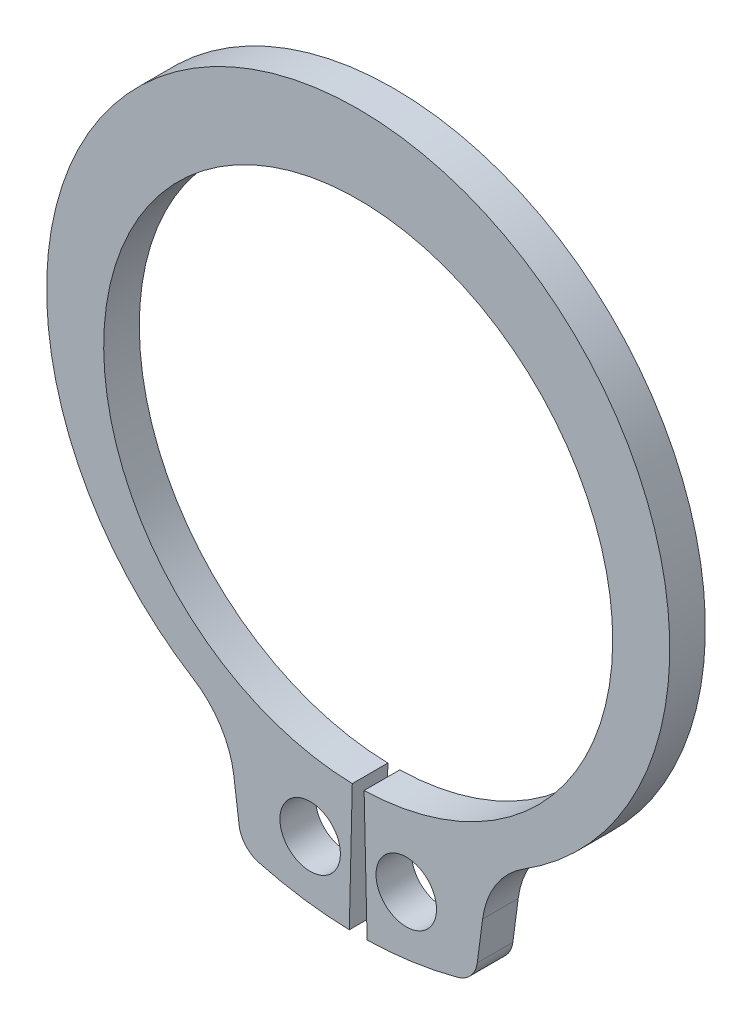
ISO-10303-21;
HEADER;
FILE_DESCRIPTION(('STEP AP214'),'2;1');
FILE_NAME('part.step','',(''),(''),'','','');
FILE_SCHEMA(('AUTOMOTIVE_DESIGN { 1 0 10303 214 1 1 1 1 }'));
ENDSEC;
DATA;
#1=APPLICATION_CONTEXT('core data for automotive mechanical design processes');
#2=APPLICATION_PROTOCOL_DEFINITION('international standard','automotive_design',2000,#1);
#3=PRODUCT_CONTEXT('',#1,'mechanical');
#4=PRODUCT('Part','Part','',(#3));
#5=PRODUCT_RELATED_PRODUCT_CATEGORY('part','',(#4));
#6=PRODUCT_DEFINITION_FORMATION('','',#4);
#7=PRODUCT_DEFINITION_CONTEXT('part definition',#1,'design');
#8=PRODUCT_DEFINITION('design','',#6,#7);
#9=PRODUCT_DEFINITION_SHAPE('','',#8);
#10=(LENGTH_UNIT() NAMED_UNIT(*) SI_UNIT(.MILLI.,.METRE.));
#11=(NAMED_UNIT(*) PLANE_ANGLE_UNIT() SI_UNIT($,.RADIAN.));
#12=(NAMED_UNIT(*) SI_UNIT($,.STERADIAN.) SOLID_ANGLE_UNIT());
#13=UNCERTAINTY_MEASURE_WITH_UNIT(LENGTH_MEASURE(1.E-05),#10,'distance_accuracy_value','');
#14=(GEOMETRIC_REPRESENTATION_CONTEXT(3) GLOBAL_UNCERTAINTY_ASSIGNED_CONTEXT((#13)) GLOBAL_UNIT_ASSIGNED_CONTEXT((#10,
#11,#12)) REPRESENTATION_CONTEXT('',''));
#15=CARTESIAN_POINT('',(0.,0.,0.));
#16=DIRECTION('',(0.,0.,1.));
#17=DIRECTION('',(1.,0.,0.));
#18=AXIS2_PLACEMENT_3D('',#15,#16,#17);
#19=CARTESIAN_POINT('',(0.,0.,-1.));
#20=DIRECTION('',(0.,0.,1.));
#21=DIRECTION('',(1.,0.,0.));
#22=AXIS2_PLACEMENT_3D('',#19,#20,#21);
#23=CYLINDRICAL_SURFACE('',#22,7.15);
#24=CARTESIAN_POINT('',(0.,0.,0.));
#25=DIRECTION('',(0.,0.,-1.));
#26=DIRECTION('',(1.,0.,0.));
#27=AXIS2_PLACEMENT_3D('',#24,#25,#26);
#28=CIRCLE('',#27,7.15);
#29=CARTESIAN_POINT('',(-0.166279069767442,-7.14806626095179,0.));
#30=VERTEX_POINT('',#29);
#31=CARTESIAN_POINT('',(0.166279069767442,-7.14806626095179,0.));
#32=VERTEX_POINT('',#31);
#33=EDGE_CURVE('E153',#30,#32,#28,.T.);
#34=ORIENTED_EDGE('',*,*,#33,.F.);
#35=DIRECTION('',(0.,0.,1.));
#36=VECTOR('',#35,1.);
#37=CARTESIAN_POINT('',(-0.166279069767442,-7.14806626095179,-1.));
#38=LINE('',#37,#36);
#39=CARTESIAN_POINT('',(-0.166279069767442,-7.14806626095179,-1.));
#40=VERTEX_POINT('',#39);
#41=EDGE_CURVE('E11',#40,#30,#38,.T.);
#42=ORIENTED_EDGE('',*,*,#41,.F.);
#43=CARTESIAN_POINT('',(0.,0.,-1.));
#44=DIRECTION('',(0.,0.,-1.));
#45=DIRECTION('',(1.,0.,0.));
#46=AXIS2_PLACEMENT_3D('',#43,#44,#45);
#47=CIRCLE('',#46,7.15);
#48=CARTESIAN_POINT('',(0.166279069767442,-7.14806626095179,-1.));
#49=VERTEX_POINT('',#48);
#50=EDGE_CURVE('E186',#40,#49,#47,.T.);
#51=ORIENTED_EDGE('',*,*,#50,.T.);
#52=DIRECTION('',(0.,0.,1.));
#53=VECTOR('',#52,1.);
#54=CARTESIAN_POINT('',(0.166279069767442,-7.14806626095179,-1.));
#55=LINE('',#54,#53);
#56=EDGE_CURVE('E35',#49,#32,#55,.T.);
#57=ORIENTED_EDGE('',*,*,#56,.T.);
#58=EDGE_LOOP('',(#34,#42,#51,#57));
#59=FACE_BOUND('',#58,.T.);
#60=ADVANCED_FACE('F32',(#59),#23,.F.);
#61=CARTESIAN_POINT('',(-0.166279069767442,-7.14806626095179,-1.));
#62=DIRECTION('',(0.999729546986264,-0.0232558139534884,0.));
#63=DIRECTION('',(0.0232558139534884,0.999729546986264,0.));
#64=AXIS2_PLACEMENT_3D('',#61,#62,#63);
#65=PLANE('',#64);
#66=DIRECTION('',(0.0232558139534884,0.999729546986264,0.));
#67=VECTOR('',#66,1.);
#68=CARTESIAN_POINT('',(-0.166279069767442,-7.14806626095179,0.));
#69=LINE('',#68,#67);
#70=CARTESIAN_POINT('',(-0.25,-10.7470926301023,0.));
#71=VERTEX_POINT('',#70);
#72=EDGE_CURVE('E184',#71,#30,#69,.T.);
#73=ORIENTED_EDGE('',*,*,#72,.F.);
#74=DIRECTION('',(0.,0.,1.));
#75=VECTOR('',#74,1.);
#76=CARTESIAN_POINT('',(-0.25,-10.7470926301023,-1.));
#77=LINE('',#76,#75);
#78=CARTESIAN_POINT('',(-0.25,-10.7470926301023,-1.));
#79=VERTEX_POINT('',#78);
#80=EDGE_CURVE('E41',#79,#71,#77,.T.);
#81=ORIENTED_EDGE('',*,*,#80,.F.);
#82=DIRECTION('',(0.0232558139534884,0.999729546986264,0.));
#83=VECTOR('',#82,1.);
#84=CARTESIAN_POINT('',(-0.166279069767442,-7.14806626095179,-1.));
#85=LINE('',#84,#83);
#86=EDGE_CURVE('E143',#79,#40,#85,.T.);
#87=ORIENTED_EDGE('',*,*,#86,.T.);
#88=ORIENTED_EDGE('',*,*,#41,.T.);
#89=EDGE_LOOP('',(#73,#81,#87,#88));
#90=FACE_BOUND('',#89,.T.);
#91=ADVANCED_FACE('F206',(#90),#65,.T.);
#92=CARTESIAN_POINT('',(0.,0.,-1.));
#93=DIRECTION('',(0.,0.,1.));
#94=DIRECTION('',(1.,0.,0.));
#95=AXIS2_PLACEMENT_3D('',#92,#93,#94);
#96=CYLINDRICAL_SURFACE('',#95,10.75);
#97=CARTESIAN_POINT('',(0.,0.,0.));
#98=DIRECTION('',(0.,0.,1.));
#99=DIRECTION('',(1.,0.,0.));
#100=AXIS2_PLACEMENT_3D('',#97,#98,#99);
#101=CIRCLE('',#100,10.75);
#102=CARTESIAN_POINT('',(-2.79605149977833,-10.3800094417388,0.));
#103=VERTEX_POINT('',#102);
#104=EDGE_CURVE('E130',#103,#71,#101,.T.);
#105=ORIENTED_EDGE('',*,*,#104,.F.);
#106=DIRECTION('',(0.,0.,1.));
#107=VECTOR('',#106,1.);
#108=CARTESIAN_POINT('',(-2.79605149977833,-10.3800094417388,-1.));
#109=LINE('',#108,#107);
#110=CARTESIAN_POINT('',(-2.79605149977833,-10.3800094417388,-1.));
#111=VERTEX_POINT('',#110);
#112=EDGE_CURVE('E125',#111,#103,#109,.T.);
#113=ORIENTED_EDGE('',*,*,#112,.F.);
#114=CARTESIAN_POINT('',(0.,0.,-1.));
#115=DIRECTION('',(0.,0.,1.));
#116=DIRECTION('',(1.,0.,0.));
#117=AXIS2_PLACEMENT_3D('',#114,#115,#116);
#118=CIRCLE('',#117,10.75);
#119=EDGE_CURVE('E128',#111,#79,#118,.T.);
#120=ORIENTED_EDGE('',*,*,#119,.T.);
#121=ORIENTED_EDGE('',*,*,#80,.T.);
#122=EDGE_LOOP('',(#105,#113,#120,#121));
#123=FACE_BOUND('',#122,.T.);
#124=ADVANCED_FACE('F127',(#123),#96,.T.);
#125=CARTESIAN_POINT('',(-2.60097813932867,-9.65582273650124,-1.));
#126=DIRECTION('',(0.,0.,1.));
#127=DIRECTION('',(1.,0.,0.));
#128=AXIS2_PLACEMENT_3D('',#125,#126,#127);
#129=CYLINDRICAL_SURFACE('',#128,0.75);
#130=CARTESIAN_POINT('',(-2.60097813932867,-9.65582273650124,0.));
#131=DIRECTION('',(0.,0.,1.));
#132=DIRECTION('',(1.,0.,0.));
#133=AXIS2_PLACEMENT_3D('',#130,#131,#132);
#134=CIRCLE('',#133,0.75);
#135=CARTESIAN_POINT('',(-3.34456178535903,-9.75371738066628,0.));
#136=VERTEX_POINT('',#135);
#137=EDGE_CURVE('E181',#136,#103,#134,.T.);
#138=ORIENTED_EDGE('',*,*,#137,.F.);
#139=DIRECTION('',(0.,0.,1.));
#140=VECTOR('',#139,1.);
#141=CARTESIAN_POINT('',(-3.34456178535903,-9.75371738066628,-1.));
#142=LINE('',#141,#140);
#143=CARTESIAN_POINT('',(-3.34456178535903,-9.75371738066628,-1.));
#144=VERTEX_POINT('',#143);
#145=EDGE_CURVE('E135',#144,#136,#142,.T.);
#146=ORIENTED_EDGE('',*,*,#145,.F.);
#147=CARTESIAN_POINT('',(-2.60097813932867,-9.65582273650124,-1.));
#148=DIRECTION('',(0.,0.,1.));
#149=DIRECTION('',(1.,0.,0.));
#150=AXIS2_PLACEMENT_3D('',#147,#148,#149);
#151=CIRCLE('',#150,0.75);
#152=EDGE_CURVE('E141',#144,#111,#151,.T.);
#153=ORIENTED_EDGE('',*,*,#152,.T.);
#154=ORIENTED_EDGE('',*,*,#112,.T.);
#155=EDGE_LOOP('',(#138,#146,#153,#154));
#156=FACE_BOUND('',#155,.T.);
#157=ADVANCED_FACE('F145',(#156),#129,.T.);
#158=CARTESIAN_POINT('',(-3.49482072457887,-8.61238742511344,-1.));
#159=DIRECTION('',(-0.99144486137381,-0.130526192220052,0.));
#160=DIRECTION('',(0.130526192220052,-0.99144486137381,0.));
#161=AXIS2_PLACEMENT_3D('',#158,#159,#160);
#162=PLANE('',#161);
#163=DIRECTION('',(0.130526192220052,-0.99144486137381,0.));
#164=VECTOR('',#163,1.);
#165=CARTESIAN_POINT('',(-3.49482072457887,-8.61238742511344,0.));
#166=LINE('',#165,#164);
#167=CARTESIAN_POINT('',(-3.49482072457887,-8.61238742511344,0.));
#168=VERTEX_POINT('',#167);
#169=EDGE_CURVE('E178',#168,#136,#166,.T.);
#170=ORIENTED_EDGE('',*,*,#169,.F.);
#171=DIRECTION('',(0.,0.,1.));
#172=VECTOR('',#171,1.);
#173=CARTESIAN_POINT('',(-3.49482072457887,-8.61238742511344,-1.));
#174=LINE('',#173,#172);
#175=CARTESIAN_POINT('',(-3.49482072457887,-8.61238742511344,-1.));
#176=VERTEX_POINT('',#175);
#177=EDGE_CURVE('E190',#176,#168,#174,.T.);
#178=ORIENTED_EDGE('',*,*,#177,.F.);
#179=DIRECTION('',(0.130526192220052,-0.99144486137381,0.));
#180=VECTOR('',#179,1.);
#181=CARTESIAN_POINT('',(-3.49482072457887,-8.61238742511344,-1.));
#182=LINE('',#181,#180);
#183=EDGE_CURVE('E146',#176,#144,#182,.T.);
#184=ORIENTED_EDGE('',*,*,#183,.T.);
#185=ORIENTED_EDGE('',*,*,#145,.T.);
#186=EDGE_LOOP('',(#170,#178,#184,#185));
#187=FACE_BOUND('',#186,.T.);
#188=ADVANCED_FACE('F219',(#187),#162,.T.);
#189=CARTESIAN_POINT('',(-5.97204747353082,-8.93852051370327,-1.));
#190=DIRECTION('',(0.,0.,1.));
#191=DIRECTION('',(1.,0.,0.));
#192=AXIS2_PLACEMENT_3D('',#189,#190,#191);
#193=CYLINDRICAL_SURFACE('',#192,2.49860264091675);
#194=CARTESIAN_POINT('',(-5.97204747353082,-8.93852051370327,0.));
#195=DIRECTION('',(0.,0.,-1.));
#196=DIRECTION('',(1.,0.,0.));
#197=AXIS2_PLACEMENT_3D('',#194,#195,#196);
#198=CIRCLE('',#197,2.49860264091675);
#199=CARTESIAN_POINT('',(-4.64583650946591,-6.82093234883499,0.));
#200=VERTEX_POINT('',#199);
#201=EDGE_CURVE('E175',#200,#168,#198,.T.);
#202=ORIENTED_EDGE('',*,*,#201,.F.);
#203=DIRECTION('',(0.,0.,1.));
#204=VECTOR('',#203,1.);
#205=CARTESIAN_POINT('',(-4.64583650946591,-6.82093234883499,-1.));
#206=LINE('',#205,#204);
#207=CARTESIAN_POINT('',(-4.64583650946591,-6.82093234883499,-1.));
#208=VERTEX_POINT('',#207);
#209=EDGE_CURVE('E192',#208,#200,#206,.T.);
#210=ORIENTED_EDGE('',*,*,#209,.F.);
#211=CARTESIAN_POINT('',(-5.97204747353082,-8.93852051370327,-1.));
#212=DIRECTION('',(0.,0.,-1.));
#213=DIRECTION('',(1.,0.,0.));
#214=AXIS2_PLACEMENT_3D('',#211,#212,#213);
#215=CIRCLE('',#214,2.49860264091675);
#216=EDGE_CURVE('E148',#208,#176,#215,.T.);
#217=ORIENTED_EDGE('',*,*,#216,.T.);
#218=ORIENTED_EDGE('',*,*,#177,.T.);
#219=EDGE_LOOP('',(#202,#210,#217,#218));
#220=FACE_BOUND('',#219,.T.);
#221=ADVANCED_FACE('F222',(#220),#193,.F.);
#222=CARTESIAN_POINT('',(0.,0.597169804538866,-1.));
#223=DIRECTION('',(0.,0.,1.));
#224=DIRECTION('',(1.,0.,0.));
#225=AXIS2_PLACEMENT_3D('',#222,#223,#224);
#226=CYLINDRICAL_SURFACE('',#225,8.75283019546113);
#227=CARTESIAN_POINT('',(0.,0.597169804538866,0.));
#228=DIRECTION('',(0.,0.,1.));
#229=DIRECTION('',(1.,0.,0.));
#230=AXIS2_PLACEMENT_3D('',#227,#228,#229);
#231=CIRCLE('',#230,8.75283019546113);
#232=CARTESIAN_POINT('',(4.64583650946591,-6.82093234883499,0.));
#233=VERTEX_POINT('',#232);
#234=EDGE_CURVE('E172',#233,#200,#231,.T.);
#235=ORIENTED_EDGE('',*,*,#234,.F.);
#236=DIRECTION('',(0.,0.,1.));
#237=VECTOR('',#236,1.);
#238=CARTESIAN_POINT('',(4.64583650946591,-6.82093234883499,-1.));
#239=LINE('',#238,#237);
#240=CARTESIAN_POINT('',(4.64583650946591,-6.82093234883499,-1.));
#241=VERTEX_POINT('',#240);
#242=EDGE_CURVE('E194',#241,#233,#239,.T.);
#243=ORIENTED_EDGE('',*,*,#242,.F.);
#244=CARTESIAN_POINT('',(0.,0.597169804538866,-1.));
#245=DIRECTION('',(0.,0.,1.));
#246=DIRECTION('',(1.,0.,0.));
#247=AXIS2_PLACEMENT_3D('',#244,#245,#246);
#248=CIRCLE('',#247,8.75283019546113);
#249=EDGE_CURVE('E296',#241,#208,#248,.T.);
#250=ORIENTED_EDGE('',*,*,#249,.T.);
#251=ORIENTED_EDGE('',*,*,#209,.T.);
#252=EDGE_LOOP('',(#235,#243,#250,#251));
#253=FACE_BOUND('',#252,.T.);
#254=ADVANCED_FACE('F226',(#253),#226,.T.);
#255=CARTESIAN_POINT('',(5.97204747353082,-8.93852051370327,-1.));
#256=DIRECTION('',(0.,0.,1.));
#257=DIRECTION('',(1.,0.,0.));
#258=AXIS2_PLACEMENT_3D('',#255,#256,#257);
#259=CYLINDRICAL_SURFACE('',#258,2.49860264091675);
#260=CARTESIAN_POINT('',(5.97204747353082,-8.93852051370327,0.));
#261=DIRECTION('',(0.,0.,-1.));
#262=DIRECTION('',(1.,0.,0.));
#263=AXIS2_PLACEMENT_3D('',#260,#261,#262);
#264=CIRCLE('',#263,2.49860264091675);
#265=CARTESIAN_POINT('',(3.49482072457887,-8.61238742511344,0.));
#266=VERTEX_POINT('',#265);
#267=EDGE_CURVE('E169',#266,#233,#264,.T.);
#268=ORIENTED_EDGE('',*,*,#267,.F.);
#269=DIRECTION('',(0.,0.,1.));
#270=VECTOR('',#269,1.);
#271=CARTESIAN_POINT('',(3.49482072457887,-8.61238742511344,-1.));
#272=LINE('',#271,#270);
#273=CARTESIAN_POINT('',(3.49482072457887,-8.61238742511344,-1.));
#274=VERTEX_POINT('',#273);
#275=EDGE_CURVE('E196',#274,#266,#272,.T.);
#276=ORIENTED_EDGE('',*,*,#275,.F.);
#277=CARTESIAN_POINT('',(5.97204747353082,-8.93852051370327,-1.));
#278=DIRECTION('',(0.,0.,-1.));
#279=DIRECTION('',(1.,0.,0.));
#280=AXIS2_PLACEMENT_3D('',#277,#278,#279);
#281=CIRCLE('',#280,2.49860264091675);
#282=EDGE_CURVE('E293',#274,#241,#281,.T.);
#283=ORIENTED_EDGE('',*,*,#282,.T.);
#284=ORIENTED_EDGE('',*,*,#242,.T.);
#285=EDGE_LOOP('',(#268,#276,#283,#284));
#286=FACE_BOUND('',#285,.T.);
#287=ADVANCED_FACE('F230',(#286),#259,.F.);
#288=CARTESIAN_POINT('',(3.49482072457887,-8.61238742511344,-1.));
#289=DIRECTION('',(0.99144486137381,-0.130526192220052,0.));
#290=DIRECTION('',(0.130526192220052,0.99144486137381,0.));
#291=AXIS2_PLACEMENT_3D('',#288,#289,#290);
#292=PLANE('',#291);
#293=DIRECTION('',(0.130526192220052,0.99144486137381,0.));
#294=VECTOR('',#293,1.);
#295=CARTESIAN_POINT('',(3.49482072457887,-8.61238742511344,0.));
#296=LINE('',#295,#294);
#297=CARTESIAN_POINT('',(3.34456178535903,-9.75371738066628,0.));
#298=VERTEX_POINT('',#297);
#299=EDGE_CURVE('E166',#298,#266,#296,.T.);
#300=ORIENTED_EDGE('',*,*,#299,.F.);
#301=DIRECTION('',(0.,0.,1.));
#302=VECTOR('',#301,1.);
#303=CARTESIAN_POINT('',(3.34456178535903,-9.75371738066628,-1.));
#304=LINE('',#303,#302);
#305=CARTESIAN_POINT('',(3.34456178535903,-9.75371738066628,-1.));
#306=VERTEX_POINT('',#305);
#307=EDGE_CURVE('E198',#306,#298,#304,.T.);
#308=ORIENTED_EDGE('',*,*,#307,.F.);
#309=DIRECTION('',(0.130526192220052,0.99144486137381,0.));
#310=VECTOR('',#309,1.);
#311=CARTESIAN_POINT('',(3.49482072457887,-8.61238742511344,-1.));
#312=LINE('',#311,#310);
#313=EDGE_CURVE('E290',#306,#274,#312,.T.);
#314=ORIENTED_EDGE('',*,*,#313,.T.);
#315=ORIENTED_EDGE('',*,*,#275,.T.);
#316=EDGE_LOOP('',(#300,#308,#314,#315));
#317=FACE_BOUND('',#316,.T.);
#318=ADVANCED_FACE('F234',(#317),#292,.T.);
#319=CARTESIAN_POINT('',(2.60097813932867,-9.65582273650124,-1.));
#320=DIRECTION('',(0.,0.,1.));
#321=DIRECTION('',(1.,0.,0.));
#322=AXIS2_PLACEMENT_3D('',#319,#320,#321);
#323=CYLINDRICAL_SURFACE('',#322,0.75);
#324=CARTESIAN_POINT('',(2.60097813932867,-9.65582273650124,0.));
#325=DIRECTION('',(0.,0.,1.));
#326=DIRECTION('',(-1.,0.,0.));
#327=AXIS2_PLACEMENT_3D('',#324,#325,#326);
#328=CIRCLE('',#327,0.75);
#329=CARTESIAN_POINT('',(2.79605149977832,-10.3800094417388,0.));
#330=VERTEX_POINT('',#329);
#331=EDGE_CURVE('E163',#330,#298,#328,.T.);
#332=ORIENTED_EDGE('',*,*,#331,.F.);
#333=DIRECTION('',(0.,0.,1.));
#334=VECTOR('',#333,1.);
#335=CARTESIAN_POINT('',(2.79605149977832,-10.3800094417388,-1.));
#336=LINE('',#335,#334);
#337=CARTESIAN_POINT('',(2.79605149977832,-10.3800094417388,-1.));
#338=VERTEX_POINT('',#337);
#339=EDGE_CURVE('E200',#338,#330,#336,.T.);
#340=ORIENTED_EDGE('',*,*,#339,.F.);
#341=CARTESIAN_POINT('',(2.60097813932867,-9.65582273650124,-1.));
#342=DIRECTION('',(0.,0.,1.));
#343=DIRECTION('',(-1.,0.,0.));
#344=AXIS2_PLACEMENT_3D('',#341,#342,#343);
#345=CIRCLE('',#344,0.75);
#346=EDGE_CURVE('E287',#338,#306,#345,.T.);
#347=ORIENTED_EDGE('',*,*,#346,.T.);
#348=ORIENTED_EDGE('',*,*,#307,.T.);
#349=EDGE_LOOP('',(#332,#340,#347,#348));
#350=FACE_BOUND('',#349,.T.);
#351=ADVANCED_FACE('F238',(#350),#323,.T.);
#352=CARTESIAN_POINT('',(0.,0.,-1.));
#353=DIRECTION('',(0.,0.,1.));
#354=DIRECTION('',(1.,0.,0.));
#355=AXIS2_PLACEMENT_3D('',#352,#353,#354);
#356=CYLINDRICAL_SURFACE('',#355,10.75);
#357=CARTESIAN_POINT('',(0.,0.,0.));
#358=DIRECTION('',(0.,0.,1.));
#359=DIRECTION('',(1.,0.,0.));
#360=AXIS2_PLACEMENT_3D('',#357,#358,#359);
#361=CIRCLE('',#360,10.75);
#362=CARTESIAN_POINT('',(0.249999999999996,-10.7470926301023,0.));
#363=VERTEX_POINT('',#362);
#364=EDGE_CURVE('E160',#363,#330,#361,.T.);
#365=ORIENTED_EDGE('',*,*,#364,.F.);
#366=DIRECTION('',(0.,0.,1.));
#367=VECTOR('',#366,1.);
#368=CARTESIAN_POINT('',(0.249999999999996,-10.7470926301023,-1.));
#369=LINE('',#368,#367);
#370=CARTESIAN_POINT('',(0.249999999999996,-10.7470926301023,-1.));
#371=VERTEX_POINT('',#370);
#372=EDGE_CURVE('E201',#371,#363,#369,.T.);
#373=ORIENTED_EDGE('',*,*,#372,.F.);
#374=CARTESIAN_POINT('',(0.,0.,-1.));
#375=DIRECTION('',(0.,0.,1.));
#376=DIRECTION('',(1.,0.,0.));
#377=AXIS2_PLACEMENT_3D('',#374,#375,#376);
#378=CIRCLE('',#377,10.75);
#379=EDGE_CURVE('E284',#371,#338,#378,.T.);
#380=ORIENTED_EDGE('',*,*,#379,.T.);
#381=ORIENTED_EDGE('',*,*,#339,.T.);
#382=EDGE_LOOP('',(#365,#373,#380,#381));
#383=FACE_BOUND('',#382,.T.);
#384=ADVANCED_FACE('F242',(#383),#356,.T.);
#385=CARTESIAN_POINT('',(0.166279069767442,-7.14806626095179,-1.));
#386=DIRECTION('',(-0.999729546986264,-0.0232558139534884,0.));
#387=DIRECTION('',(0.0232558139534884,-0.999729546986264,0.));
#388=AXIS2_PLACEMENT_3D('',#385,#386,#387);
#389=PLANE('',#388);
#390=DIRECTION('',(0.0232558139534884,-0.999729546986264,0.));
#391=VECTOR('',#390,1.);
#392=CARTESIAN_POINT('',(0.166279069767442,-7.14806626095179,0.));
#393=LINE('',#392,#391);
#394=EDGE_CURVE('E156',#32,#363,#393,.T.);
#395=ORIENTED_EDGE('',*,*,#394,.F.);
#396=ORIENTED_EDGE('',*,*,#56,.F.);
#397=DIRECTION('',(0.0232558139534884,-0.999729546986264,0.));
#398=VECTOR('',#397,1.);
#399=CARTESIAN_POINT('',(0.166279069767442,-7.14806626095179,-1.));
#400=LINE('',#399,#398);
#401=EDGE_CURVE('E282',#49,#371,#400,.T.);
#402=ORIENTED_EDGE('',*,*,#401,.T.);
#403=ORIENTED_EDGE('',*,*,#372,.T.);
#404=EDGE_LOOP('',(#395,#396,#402,#403));
#405=FACE_BOUND('',#404,.T.);
#406=ADVANCED_FACE('F203',(#405),#389,.T.);
#407=CARTESIAN_POINT('',(0.,0.,-1.));
#408=DIRECTION('',(0.,0.,1.));
#409=DIRECTION('',(1.,0.,0.));
#410=AXIS2_PLACEMENT_3D('',#407,#408,#409);
#411=PLANE('',#410);
#412=CARTESIAN_POINT('',(-1.35,-9.02458447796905,-1.));
#413=DIRECTION('',(0.,0.,1.));
#414=DIRECTION('',(1.,0.,0.));
#415=AXIS2_PLACEMENT_3D('',#412,#413,#414);
#416=CIRCLE('',#415,0.85);
#417=CARTESIAN_POINT('',(-0.5,-9.02458447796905,-1.));
#418=VERTEX_POINT('',#417);
#419=EDGE_CURVE('E269',#418,#418,#416,.T.);
#420=ORIENTED_EDGE('',*,*,#419,.T.);
#421=EDGE_LOOP('',(#420));
#422=FACE_BOUND('',#421,.T.);
#423=CARTESIAN_POINT('',(1.35,-9.02458447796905,-1.));
#424=DIRECTION('',(0.,0.,1.));
#425=DIRECTION('',(1.,0.,0.));
#426=AXIS2_PLACEMENT_3D('',#423,#424,#425);
#427=CIRCLE('',#426,0.85);
#428=CARTESIAN_POINT('',(2.2,-9.02458447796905,-1.));
#429=VERTEX_POINT('',#428);
#430=EDGE_CURVE('E157',#429,#429,#427,.T.);
#431=ORIENTED_EDGE('',*,*,#430,.T.);
#432=EDGE_LOOP('',(#431));
#433=FACE_BOUND('',#432,.T.);
#434=ORIENTED_EDGE('',*,*,#50,.F.);
#435=ORIENTED_EDGE('',*,*,#86,.F.);
#436=ORIENTED_EDGE('',*,*,#119,.F.);
#437=ORIENTED_EDGE('',*,*,#152,.F.);
#438=ORIENTED_EDGE('',*,*,#183,.F.);
#439=ORIENTED_EDGE('',*,*,#216,.F.);
#440=ORIENTED_EDGE('',*,*,#249,.F.);
#441=ORIENTED_EDGE('',*,*,#282,.F.);
#442=ORIENTED_EDGE('',*,*,#313,.F.);
#443=ORIENTED_EDGE('',*,*,#346,.F.);
#444=ORIENTED_EDGE('',*,*,#379,.F.);
#445=ORIENTED_EDGE('',*,*,#401,.F.);
#446=EDGE_LOOP('',(#434,#435,#436,#437,#438,#439,#440,#441,#442,#443,#444,#445));
#447=FACE_BOUND('',#446,.T.);
#448=ADVANCED_FACE('F139',(#422,#433,#447),#411,.F.);
#449=CARTESIAN_POINT('',(0.,0.,0.));
#450=DIRECTION('',(0.,0.,1.));
#451=DIRECTION('',(1.,0.,0.));
#452=AXIS2_PLACEMENT_3D('',#449,#450,#451);
#453=PLANE('',#452);
#454=CARTESIAN_POINT('',(-1.35,-9.02458447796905,0.));
#455=DIRECTION('',(0.,0.,1.));
#456=DIRECTION('',(1.,0.,0.));
#457=AXIS2_PLACEMENT_3D('',#454,#455,#456);
#458=CIRCLE('',#457,0.85);
#459=CARTESIAN_POINT('',(-0.5,-9.02458447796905,0.));
#460=VERTEX_POINT('',#459);
#461=EDGE_CURVE('E272',#460,#460,#458,.T.);
#462=ORIENTED_EDGE('',*,*,#461,.F.);
#463=EDGE_LOOP('',(#462));
#464=FACE_BOUND('',#463,.T.);
#465=CARTESIAN_POINT('',(1.35,-9.02458447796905,0.));
#466=DIRECTION('',(0.,0.,1.));
#467=DIRECTION('',(1.,0.,0.));
#468=AXIS2_PLACEMENT_3D('',#465,#466,#467);
#469=CIRCLE('',#468,0.85);
#470=CARTESIAN_POINT('',(2.2,-9.02458447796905,0.));
#471=VERTEX_POINT('',#470);
#472=EDGE_CURVE('E274',#471,#471,#469,.T.);
#473=ORIENTED_EDGE('',*,*,#472,.F.);
#474=EDGE_LOOP('',(#473));
#475=FACE_BOUND('',#474,.T.);
#476=ORIENTED_EDGE('',*,*,#33,.T.);
#477=ORIENTED_EDGE('',*,*,#394,.T.);
#478=ORIENTED_EDGE('',*,*,#364,.T.);
#479=ORIENTED_EDGE('',*,*,#331,.T.);
#480=ORIENTED_EDGE('',*,*,#299,.T.);
#481=ORIENTED_EDGE('',*,*,#267,.T.);
#482=ORIENTED_EDGE('',*,*,#234,.T.);
#483=ORIENTED_EDGE('',*,*,#201,.T.);
#484=ORIENTED_EDGE('',*,*,#169,.T.);
#485=ORIENTED_EDGE('',*,*,#137,.T.);
#486=ORIENTED_EDGE('',*,*,#104,.T.);
#487=ORIENTED_EDGE('',*,*,#72,.T.);
#488=EDGE_LOOP('',(#476,#477,#478,#479,#480,#481,#482,#483,#484,#485,#486,#487));
#489=FACE_BOUND('',#488,.T.);
#490=ADVANCED_FACE('F205',(#464,#475,#489),#453,.T.);
#491=CARTESIAN_POINT('',(1.35,-9.02458447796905,-1.));
#492=DIRECTION('',(0.,0.,1.));
#493=DIRECTION('',(1.,0.,0.));
#494=AXIS2_PLACEMENT_3D('',#491,#492,#493);
#495=CYLINDRICAL_SURFACE('',#494,0.85);
#496=ORIENTED_EDGE('',*,*,#430,.F.);
#497=EDGE_LOOP('',(#496));
#498=FACE_BOUND('',#497,.T.);
#499=ORIENTED_EDGE('',*,*,#472,.T.);
#500=EDGE_LOOP('',(#499));
#501=FACE_BOUND('',#500,.T.);
#502=ADVANCED_FACE('F254',(#498,#501),#495,.F.);
#503=CARTESIAN_POINT('',(-1.35,-9.02458447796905,-1.));
#504=DIRECTION('',(0.,0.,1.));
#505=DIRECTION('',(1.,0.,0.));
#506=AXIS2_PLACEMENT_3D('',#503,#504,#505);
#507=CYLINDRICAL_SURFACE('',#506,0.85);
#508=ORIENTED_EDGE('',*,*,#419,.F.);
#509=EDGE_LOOP('',(#508));
#510=FACE_BOUND('',#509,.T.);
#511=ORIENTED_EDGE('',*,*,#461,.T.);
#512=EDGE_LOOP('',(#511));
#513=FACE_BOUND('',#512,.T.);
#514=ADVANCED_FACE('F261',(#510,#513),#507,.F.);
#515=CLOSED_SHELL('',(#60,#91,#124,#157,#188,#221,#254,#287,#318,#351,#384,#406,#448,#490,#502,#514));
#516=MANIFOLD_SOLID_BREP('B2',#515);
#517=ADVANCED_BREP_SHAPE_REPRESENTATION('',(#18,#516),#14);
#518=SHAPE_DEFINITION_REPRESENTATION(#9,#517);
ENDSEC;
END-ISO-10303-21;
